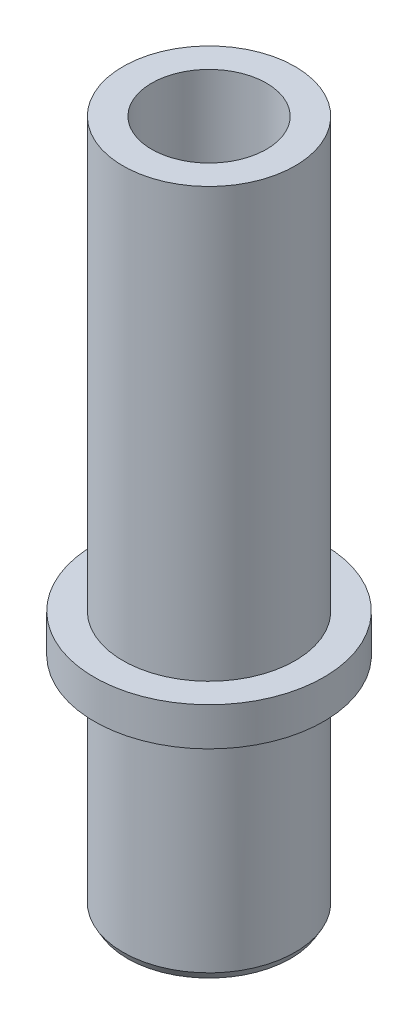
ISO-10303-21;
HEADER;
FILE_DESCRIPTION(('STEP AP214'),'2;1');
FILE_NAME('part.step','',(''),(''),'','','');
FILE_SCHEMA(('AUTOMOTIVE_DESIGN { 1 0 10303 214 1 1 1 1 }'));
ENDSEC;
DATA;
#1=APPLICATION_CONTEXT('core data for automotive mechanical design processes');
#2=APPLICATION_PROTOCOL_DEFINITION('international standard','automotive_design',2000,#1);
#3=PRODUCT_CONTEXT('',#1,'mechanical');
#4=PRODUCT('Part','Part','',(#3));
#5=PRODUCT_RELATED_PRODUCT_CATEGORY('part','',(#4));
#6=PRODUCT_DEFINITION_FORMATION('','',#4);
#7=PRODUCT_DEFINITION_CONTEXT('part definition',#1,'design');
#8=PRODUCT_DEFINITION('design','',#6,#7);
#9=PRODUCT_DEFINITION_SHAPE('','',#8);
#10=(LENGTH_UNIT() NAMED_UNIT(*) SI_UNIT(.MILLI.,.METRE.));
#11=(NAMED_UNIT(*) PLANE_ANGLE_UNIT() SI_UNIT($,.RADIAN.));
#12=(NAMED_UNIT(*) SI_UNIT($,.STERADIAN.) SOLID_ANGLE_UNIT());
#13=UNCERTAINTY_MEASURE_WITH_UNIT(LENGTH_MEASURE(1.E-05),#10,'distance_accuracy_value','');
#14=(GEOMETRIC_REPRESENTATION_CONTEXT(3) GLOBAL_UNCERTAINTY_ASSIGNED_CONTEXT((#13)) GLOBAL_UNIT_ASSIGNED_CONTEXT((#10,
#11,#12)) REPRESENTATION_CONTEXT('',''));
#15=CARTESIAN_POINT('',(0.,0.,0.));
#16=DIRECTION('',(0.,0.,1.));
#17=DIRECTION('',(1.,0.,0.));
#18=AXIS2_PLACEMENT_3D('',#15,#16,#17);
#19=CARTESIAN_POINT('',(0.,0.,0.));
#20=DIRECTION('',(0.,-1.,0.));
#21=DIRECTION('',(0.,0.,-1.));
#22=AXIS2_PLACEMENT_3D('',#19,#20,#21);
#23=CYLINDRICAL_SURFACE('',#22,22.5);
#24=CARTESIAN_POINT('',(0.,179.999999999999,0.));
#25=DIRECTION('',(0.,-1.,0.));
#26=DIRECTION('',(0.,0.,-1.));
#27=AXIS2_PLACEMENT_3D('',#24,#25,#26);
#28=CIRCLE('',#27,22.5);
#29=CARTESIAN_POINT('',(0.,179.999999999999,-22.5));
#30=VERTEX_POINT('',#29);
#31=EDGE_CURVE('E90',#30,#30,#28,.T.);
#32=ORIENTED_EDGE('',*,*,#31,.T.);
#33=EDGE_LOOP('',(#32));
#34=FACE_BOUND('',#33,.T.);
#35=CARTESIAN_POINT('',(0.,68.,0.));
#36=DIRECTION('',(0.,-1.,0.));
#37=DIRECTION('',(0.,0.,-1.));
#38=AXIS2_PLACEMENT_3D('',#35,#36,#37);
#39=CIRCLE('',#38,22.5);
#40=CARTESIAN_POINT('',(0.,68.,-22.5));
#41=VERTEX_POINT('',#40);
#42=EDGE_CURVE('E87',#41,#41,#39,.T.);
#43=ORIENTED_EDGE('',*,*,#42,.F.);
#44=EDGE_LOOP('',(#43));
#45=FACE_BOUND('',#44,.T.);
#46=ADVANCED_FACE('F34',(#34,#45),#23,.T.);
#47=CARTESIAN_POINT('',(0.,0.,0.));
#48=DIRECTION('',(0.,-1.,0.));
#49=DIRECTION('',(0.,0.,-1.));
#50=AXIS2_PLACEMENT_3D('',#47,#48,#49);
#51=CYLINDRICAL_SURFACE('',#50,15.);
#52=CARTESIAN_POINT('',(0.,179.999999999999,0.));
#53=DIRECTION('',(0.,-1.,0.));
#54=DIRECTION('',(0.,0.,-1.));
#55=AXIS2_PLACEMENT_3D('',#52,#53,#54);
#56=CIRCLE('',#55,15.);
#57=CARTESIAN_POINT('',(0.,179.999999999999,-15.));
#58=VERTEX_POINT('',#57);
#59=EDGE_CURVE('E38',#58,#58,#56,.F.);
#60=ORIENTED_EDGE('',*,*,#59,.T.);
#61=EDGE_LOOP('',(#60));
#62=FACE_BOUND('',#61,.T.);
#63=CARTESIAN_POINT('',(0.,149.999999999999,0.));
#64=DIRECTION('',(0.,-1.,0.));
#65=DIRECTION('',(0.,0.,-1.));
#66=AXIS2_PLACEMENT_3D('',#63,#64,#65);
#67=CIRCLE('',#66,15.);
#68=CARTESIAN_POINT('',(0.,149.999999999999,-15.));
#69=VERTEX_POINT('',#68);
#70=EDGE_CURVE('E54',#69,#69,#67,.T.);
#71=ORIENTED_EDGE('',*,*,#70,.T.);
#72=EDGE_LOOP('',(#71));
#73=FACE_BOUND('',#72,.T.);
#74=ADVANCED_FACE('F97',(#62,#73),#51,.F.);
#75=CARTESIAN_POINT('',(-15.5,149.999999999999,0.));
#76=DIRECTION('',(0.,1.,0.));
#77=DIRECTION('',(0.,0.,1.));
#78=AXIS2_PLACEMENT_3D('',#75,#76,#77);
#79=PLANE('',#78);
#80=ORIENTED_EDGE('',*,*,#70,.F.);
#81=EDGE_LOOP('',(#80));
#82=FACE_BOUND('',#81,.T.);
#83=CARTESIAN_POINT('',(0.,149.999999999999,0.));
#84=DIRECTION('',(0.,-1.,0.));
#85=DIRECTION('',(0.,0.,-1.));
#86=AXIS2_PLACEMENT_3D('',#83,#84,#85);
#87=CIRCLE('',#86,15.5);
#88=CARTESIAN_POINT('',(0.,149.999999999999,-15.5));
#89=VERTEX_POINT('',#88);
#90=EDGE_CURVE('E57',#89,#89,#87,.T.);
#91=ORIENTED_EDGE('',*,*,#90,.T.);
#92=EDGE_LOOP('',(#91));
#93=FACE_BOUND('',#92,.T.);
#94=ADVANCED_FACE('F115',(#82,#93),#79,.F.);
#95=CARTESIAN_POINT('',(0.,0.,0.));
#96=DIRECTION('',(0.,-1.,0.));
#97=DIRECTION('',(0.,0.,-1.));
#98=AXIS2_PLACEMENT_3D('',#95,#96,#97);
#99=CYLINDRICAL_SURFACE('',#98,15.5);
#100=ORIENTED_EDGE('',*,*,#90,.F.);
#101=EDGE_LOOP('',(#100));
#102=FACE_BOUND('',#101,.T.);
#103=CARTESIAN_POINT('',(0.,50.,0.));
#104=DIRECTION('',(0.,-1.,0.));
#105=DIRECTION('',(0.,0.,-1.));
#106=AXIS2_PLACEMENT_3D('',#103,#104,#105);
#107=CIRCLE('',#106,15.5);
#108=CARTESIAN_POINT('',(0.,50.,-15.5));
#109=VERTEX_POINT('',#108);
#110=EDGE_CURVE('E60',#109,#109,#107,.T.);
#111=ORIENTED_EDGE('',*,*,#110,.T.);
#112=EDGE_LOOP('',(#111));
#113=FACE_BOUND('',#112,.T.);
#114=ADVANCED_FACE('F166',(#102,#113),#99,.F.);
#115=CARTESIAN_POINT('',(-15.,50.,0.));
#116=DIRECTION('',(0.,-1.,0.));
#117=DIRECTION('',(0.,0.,-1.));
#118=AXIS2_PLACEMENT_3D('',#115,#116,#117);
#119=PLANE('',#118);
#120=ORIENTED_EDGE('',*,*,#110,.F.);
#121=EDGE_LOOP('',(#120));
#122=FACE_BOUND('',#121,.T.);
#123=CARTESIAN_POINT('',(0.,50.,0.));
#124=DIRECTION('',(0.,-1.,0.));
#125=DIRECTION('',(0.,0.,-1.));
#126=AXIS2_PLACEMENT_3D('',#123,#124,#125);
#127=CIRCLE('',#126,15.);
#128=CARTESIAN_POINT('',(0.,50.,-15.));
#129=VERTEX_POINT('',#128);
#130=EDGE_CURVE('E63',#129,#129,#127,.T.);
#131=ORIENTED_EDGE('',*,*,#130,.T.);
#132=EDGE_LOOP('',(#131));
#133=FACE_BOUND('',#132,.T.);
#134=ADVANCED_FACE('F162',(#122,#133),#119,.F.);
#135=CARTESIAN_POINT('',(0.,0.,0.));
#136=DIRECTION('',(0.,-1.,0.));
#137=DIRECTION('',(0.,0.,-1.));
#138=AXIS2_PLACEMENT_3D('',#135,#136,#137);
#139=CYLINDRICAL_SURFACE('',#138,15.);
#140=ORIENTED_EDGE('',*,*,#130,.F.);
#141=EDGE_LOOP('',(#140));
#142=FACE_BOUND('',#141,.T.);
#143=CARTESIAN_POINT('',(0.,7.79999999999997,0.));
#144=DIRECTION('',(0.,-1.,0.));
#145=DIRECTION('',(0.,0.,-1.));
#146=AXIS2_PLACEMENT_3D('',#143,#144,#145);
#147=CIRCLE('',#146,15.);
#148=CARTESIAN_POINT('',(0.,7.79999999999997,-15.));
#149=VERTEX_POINT('',#148);
#150=EDGE_CURVE('E66',#149,#149,#147,.T.);
#151=ORIENTED_EDGE('',*,*,#150,.T.);
#152=EDGE_LOOP('',(#151));
#153=FACE_BOUND('',#152,.T.);
#154=ADVANCED_FACE('F158',(#142,#153),#139,.F.);
#155=CARTESIAN_POINT('',(-18.1000000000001,7.80000000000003,0.));
#156=DIRECTION('',(0.,1.,0.));
#157=DIRECTION('',(0.,0.,1.));
#158=AXIS2_PLACEMENT_3D('',#155,#156,#157);
#159=PLANE('',#158);
#160=ORIENTED_EDGE('',*,*,#150,.F.);
#161=EDGE_LOOP('',(#160));
#162=FACE_BOUND('',#161,.T.);
#163=CARTESIAN_POINT('',(0.,7.79999999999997,0.));
#164=DIRECTION('',(0.,-1.,0.));
#165=DIRECTION('',(0.,0.,-1.));
#166=AXIS2_PLACEMENT_3D('',#163,#164,#165);
#167=CIRCLE('',#166,18.1);
#168=CARTESIAN_POINT('',(0.,7.79999999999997,-18.1));
#169=VERTEX_POINT('',#168);
#170=EDGE_CURVE('E69',#169,#169,#167,.T.);
#171=ORIENTED_EDGE('',*,*,#170,.T.);
#172=EDGE_LOOP('',(#171));
#173=FACE_BOUND('',#172,.T.);
#174=ADVANCED_FACE('F154',(#162,#173),#159,.F.);
#175=CARTESIAN_POINT('',(0.,0.,0.));
#176=DIRECTION('',(0.,-1.,0.));
#177=DIRECTION('',(0.,0.,-1.));
#178=AXIS2_PLACEMENT_3D('',#175,#176,#177);
#179=CYLINDRICAL_SURFACE('',#178,18.1);
#180=ORIENTED_EDGE('',*,*,#170,.F.);
#181=EDGE_LOOP('',(#180));
#182=FACE_BOUND('',#181,.T.);
#183=CARTESIAN_POINT('',(0.,3.,0.));
#184=DIRECTION('',(0.,-1.,0.));
#185=DIRECTION('',(0.,0.,-1.));
#186=AXIS2_PLACEMENT_3D('',#183,#184,#185);
#187=CIRCLE('',#186,18.1);
#188=CARTESIAN_POINT('',(0.,3.,-18.1));
#189=VERTEX_POINT('',#188);
#190=EDGE_CURVE('E72',#189,#189,#187,.T.);
#191=ORIENTED_EDGE('',*,*,#190,.T.);
#192=EDGE_LOOP('',(#191));
#193=FACE_BOUND('',#192,.T.);
#194=ADVANCED_FACE('F150',(#182,#193),#179,.F.);
#195=CARTESIAN_POINT('',(-17.0000000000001,2.99999999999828,0.));
#196=DIRECTION('',(0.,-1.,0.));
#197=DIRECTION('',(0.,0.,-1.));
#198=AXIS2_PLACEMENT_3D('',#195,#196,#197);
#199=PLANE('',#198);
#200=ORIENTED_EDGE('',*,*,#190,.F.);
#201=EDGE_LOOP('',(#200));
#202=FACE_BOUND('',#201,.T.);
#203=CARTESIAN_POINT('',(0.,3.,0.));
#204=DIRECTION('',(0.,-1.,0.));
#205=DIRECTION('',(0.,0.,-1.));
#206=AXIS2_PLACEMENT_3D('',#203,#204,#205);
#207=CIRCLE('',#206,17.);
#208=CARTESIAN_POINT('',(0.,3.,-17.));
#209=VERTEX_POINT('',#208);
#210=EDGE_CURVE('E75',#209,#209,#207,.T.);
#211=ORIENTED_EDGE('',*,*,#210,.T.);
#212=EDGE_LOOP('',(#211));
#213=FACE_BOUND('',#212,.T.);
#214=ADVANCED_FACE('F143',(#202,#213),#199,.F.);
#215=CARTESIAN_POINT('',(0.,0.,0.));
#216=DIRECTION('',(0.,-1.,0.));
#217=DIRECTION('',(0.,0.,-1.));
#218=AXIS2_PLACEMENT_3D('',#215,#216,#217);
#219=CYLINDRICAL_SURFACE('',#218,17.);
#220=CARTESIAN_POINT('',(0.,0.999999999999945,0.));
#221=DIRECTION('',(0.,1.,0.));
#222=DIRECTION('',(0.,0.,1.));
#223=AXIS2_PLACEMENT_3D('',#220,#221,#222);
#224=CIRCLE('',#223,17.);
#225=CARTESIAN_POINT('',(0.,0.999999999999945,17.));
#226=VERTEX_POINT('',#225);
#227=EDGE_CURVE('E42',#226,#226,#224,.F.);
#228=ORIENTED_EDGE('',*,*,#227,.T.);
#229=EDGE_LOOP('',(#228));
#230=FACE_BOUND('',#229,.T.);
#231=ORIENTED_EDGE('',*,*,#210,.F.);
#232=EDGE_LOOP('',(#231));
#233=FACE_BOUND('',#232,.T.);
#234=ADVANCED_FACE('F134',(#230,#233),#219,.F.);
#235=CARTESIAN_POINT('',(-22.5000000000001,-1.72084568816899E-12,0.));
#236=DIRECTION('',(0.,1.,0.));
#237=DIRECTION('',(0.,0.,1.));
#238=AXIS2_PLACEMENT_3D('',#235,#236,#237);
#239=PLANE('',#238);
#240=CARTESIAN_POINT('',(0.,0.,0.));
#241=DIRECTION('',(0.,1.,0.));
#242=DIRECTION('',(0.,0.,1.));
#243=AXIS2_PLACEMENT_3D('',#240,#241,#242);
#244=CIRCLE('',#243,17.5773502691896);
#245=CARTESIAN_POINT('',(0.,0.,17.5773502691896));
#246=VERTEX_POINT('',#245);
#247=EDGE_CURVE('E10',#246,#246,#244,.T.);
#248=ORIENTED_EDGE('',*,*,#247,.T.);
#249=EDGE_LOOP('',(#248));
#250=FACE_BOUND('',#249,.T.);
#251=CARTESIAN_POINT('',(0.,0.,0.));
#252=DIRECTION('',(0.,1.,0.));
#253=DIRECTION('',(0.,0.,1.));
#254=AXIS2_PLACEMENT_3D('',#251,#252,#253);
#255=CIRCLE('',#254,21.3452994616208);
#256=CARTESIAN_POINT('',(0.,0.,21.3452994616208));
#257=VERTEX_POINT('',#256);
#258=EDGE_CURVE('E51',#257,#257,#255,.F.);
#259=ORIENTED_EDGE('',*,*,#258,.T.);
#260=EDGE_LOOP('',(#259));
#261=FACE_BOUND('',#260,.T.);
#262=ADVANCED_FACE('F131',(#250,#261),#239,.F.);
#263=CARTESIAN_POINT('',(0.,0.,0.));
#264=DIRECTION('',(0.,-1.,0.));
#265=DIRECTION('',(0.,0.,-1.));
#266=AXIS2_PLACEMENT_3D('',#263,#264,#265);
#267=CYLINDRICAL_SURFACE('',#266,22.5);
#268=CARTESIAN_POINT('',(-1.11022302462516E-13,2.,0.));
#269=DIRECTION('',(0.,1.,0.));
#270=DIRECTION('',(0.,0.,1.));
#271=AXIS2_PLACEMENT_3D('',#268,#269,#270);
#272=CIRCLE('',#271,22.5);
#273=CARTESIAN_POINT('',(-1.11022302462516E-13,2.,22.5));
#274=VERTEX_POINT('',#273);
#275=EDGE_CURVE('E46',#274,#274,#272,.T.);
#276=ORIENTED_EDGE('',*,*,#275,.T.);
#277=EDGE_LOOP('',(#276));
#278=FACE_BOUND('',#277,.T.);
#279=CARTESIAN_POINT('',(0.,58.,0.));
#280=DIRECTION('',(0.,-1.,0.));
#281=DIRECTION('',(0.,0.,-1.));
#282=AXIS2_PLACEMENT_3D('',#279,#280,#281);
#283=CIRCLE('',#282,22.5);
#284=CARTESIAN_POINT('',(0.,58.,-22.5));
#285=VERTEX_POINT('',#284);
#286=EDGE_CURVE('E78',#285,#285,#283,.T.);
#287=ORIENTED_EDGE('',*,*,#286,.T.);
#288=EDGE_LOOP('',(#287));
#289=FACE_BOUND('',#288,.T.);
#290=ADVANCED_FACE('F133',(#278,#289),#267,.T.);
#291=CARTESIAN_POINT('',(-30.,57.9999999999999,0.));
#292=DIRECTION('',(0.,1.,0.));
#293=DIRECTION('',(0.,0.,1.));
#294=AXIS2_PLACEMENT_3D('',#291,#292,#293);
#295=PLANE('',#294);
#296=ORIENTED_EDGE('',*,*,#286,.F.);
#297=EDGE_LOOP('',(#296));
#298=FACE_BOUND('',#297,.T.);
#299=CARTESIAN_POINT('',(0.,58.,0.));
#300=DIRECTION('',(0.,-1.,0.));
#301=DIRECTION('',(0.,0.,-1.));
#302=AXIS2_PLACEMENT_3D('',#299,#300,#301);
#303=CIRCLE('',#302,30.);
#304=CARTESIAN_POINT('',(0.,58.,-30.));
#305=VERTEX_POINT('',#304);
#306=EDGE_CURVE('E81',#305,#305,#303,.T.);
#307=ORIENTED_EDGE('',*,*,#306,.T.);
#308=EDGE_LOOP('',(#307));
#309=FACE_BOUND('',#308,.T.);
#310=ADVANCED_FACE('F140',(#298,#309),#295,.F.);
#311=CARTESIAN_POINT('',(0.,0.,0.));
#312=DIRECTION('',(0.,-1.,0.));
#313=DIRECTION('',(0.,0.,-1.));
#314=AXIS2_PLACEMENT_3D('',#311,#312,#313);
#315=CYLINDRICAL_SURFACE('',#314,30.);
#316=ORIENTED_EDGE('',*,*,#306,.F.);
#317=EDGE_LOOP('',(#316));
#318=FACE_BOUND('',#317,.T.);
#319=CARTESIAN_POINT('',(0.,68.,0.));
#320=DIRECTION('',(0.,-1.,0.));
#321=DIRECTION('',(0.,0.,-1.));
#322=AXIS2_PLACEMENT_3D('',#319,#320,#321);
#323=CIRCLE('',#322,30.);
#324=CARTESIAN_POINT('',(0.,68.,-30.));
#325=VERTEX_POINT('',#324);
#326=EDGE_CURVE('E84',#325,#325,#323,.T.);
#327=ORIENTED_EDGE('',*,*,#326,.T.);
#328=EDGE_LOOP('',(#327));
#329=FACE_BOUND('',#328,.T.);
#330=ADVANCED_FACE('F125',(#318,#329),#315,.T.);
#331=CARTESIAN_POINT('',(-22.5000000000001,67.9999999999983,0.));
#332=DIRECTION('',(0.,-1.,0.));
#333=DIRECTION('',(0.,0.,-1.));
#334=AXIS2_PLACEMENT_3D('',#331,#332,#333);
#335=PLANE('',#334);
#336=ORIENTED_EDGE('',*,*,#326,.F.);
#337=EDGE_LOOP('',(#336));
#338=FACE_BOUND('',#337,.T.);
#339=ORIENTED_EDGE('',*,*,#42,.T.);
#340=EDGE_LOOP('',(#339));
#341=FACE_BOUND('',#340,.T.);
#342=ADVANCED_FACE('F120',(#338,#341),#335,.F.);
#343=CARTESIAN_POINT('',(0.,0.,0.));
#344=DIRECTION('',(0.,1.,0.));
#345=DIRECTION('',(0.,0.,1.));
#346=AXIS2_PLACEMENT_3D('',#343,#344,#345);
#347=CONICAL_SURFACE('',#346,21.3452994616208,0.523598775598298);
#348=ORIENTED_EDGE('',*,*,#275,.F.);
#349=EDGE_LOOP('',(#348));
#350=FACE_BOUND('',#349,.T.);
#351=ORIENTED_EDGE('',*,*,#258,.F.);
#352=EDGE_LOOP('',(#351));
#353=FACE_BOUND('',#352,.T.);
#354=ADVANCED_FACE('F107',(#350,#353),#347,.T.);
#355=CARTESIAN_POINT('',(0.,0.999999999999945,0.));
#356=DIRECTION('',(0.,-1.,0.));
#357=DIRECTION('',(0.,0.,-1.));
#358=AXIS2_PLACEMENT_3D('',#355,#356,#357);
#359=CONICAL_SURFACE('',#358,17.,0.523598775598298);
#360=ORIENTED_EDGE('',*,*,#247,.F.);
#361=EDGE_LOOP('',(#360));
#362=FACE_BOUND('',#361,.T.);
#363=ORIENTED_EDGE('',*,*,#227,.F.);
#364=EDGE_LOOP('',(#363));
#365=FACE_BOUND('',#364,.T.);
#366=ADVANCED_FACE('F36',(#362,#365),#359,.F.);
#367=CARTESIAN_POINT('',(-22.5,179.999999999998,-25.));
#368=DIRECTION('',(0.,-1.,0.));
#369=DIRECTION('',(0.,0.,-1.));
#370=AXIS2_PLACEMENT_3D('',#367,#368,#369);
#371=PLANE('',#370);
#372=ORIENTED_EDGE('',*,*,#59,.F.);
#373=EDGE_LOOP('',(#372));
#374=FACE_BOUND('',#373,.T.);
#375=ORIENTED_EDGE('',*,*,#31,.F.);
#376=EDGE_LOOP('',(#375));
#377=FACE_BOUND('',#376,.T.);
#378=ADVANCED_FACE('F100',(#374,#377),#371,.F.);
#379=CLOSED_SHELL('',(#46,#74,#94,#114,#134,#154,#174,#194,#214,#234,#262,#290,#310,#330,#342,
#354,#366,#378));
#380=MANIFOLD_SOLID_BREP('B2',#379);
#381=ADVANCED_BREP_SHAPE_REPRESENTATION('',(#18,#380),#14);
#382=SHAPE_DEFINITION_REPRESENTATION(#9,#381);
ENDSEC;
END-ISO-10303-21;
